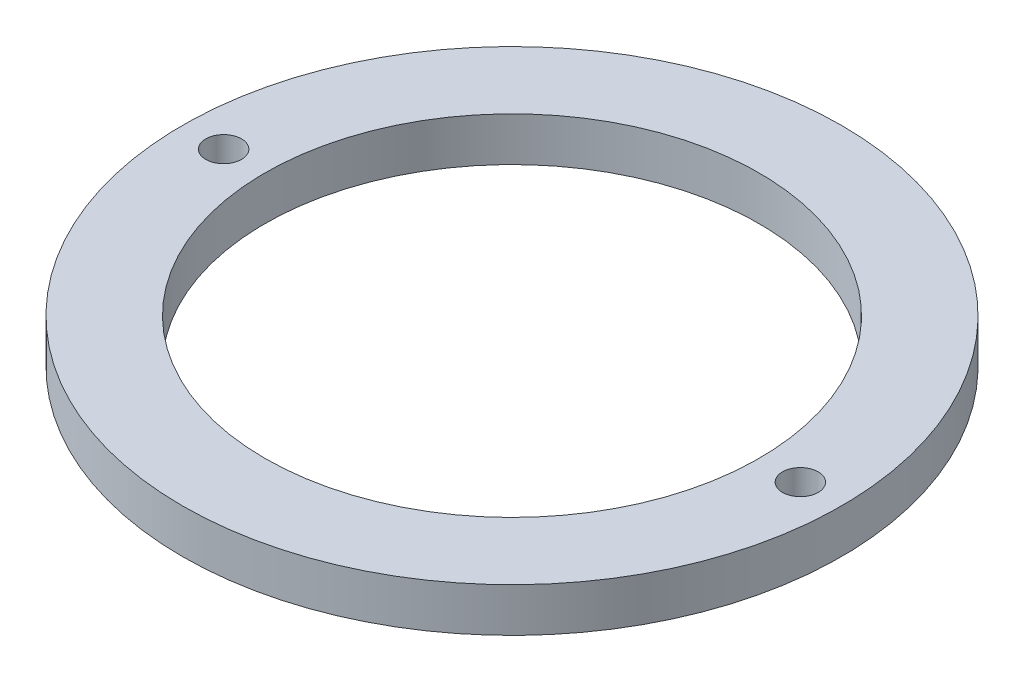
ISO-10303-21;
HEADER;
FILE_DESCRIPTION(('STEP AP214'),'2;1');
FILE_NAME('part.step','',(''),(''),'','','');
FILE_SCHEMA(('AUTOMOTIVE_DESIGN { 1 0 10303 214 1 1 1 1 }'));
ENDSEC;
DATA;
#1=APPLICATION_CONTEXT('core data for automotive mechanical design processes');
#2=APPLICATION_PROTOCOL_DEFINITION('international standard','automotive_design',2000,#1);
#3=PRODUCT_CONTEXT('',#1,'mechanical');
#4=PRODUCT('Part','Part','',(#3));
#5=PRODUCT_RELATED_PRODUCT_CATEGORY('part','',(#4));
#6=PRODUCT_DEFINITION_FORMATION('','',#4);
#7=PRODUCT_DEFINITION_CONTEXT('part definition',#1,'design');
#8=PRODUCT_DEFINITION('design','',#6,#7);
#9=PRODUCT_DEFINITION_SHAPE('','',#8);
#10=(LENGTH_UNIT() NAMED_UNIT(*) SI_UNIT(.MILLI.,.METRE.));
#11=(NAMED_UNIT(*) PLANE_ANGLE_UNIT() SI_UNIT($,.RADIAN.));
#12=(NAMED_UNIT(*) SI_UNIT($,.STERADIAN.) SOLID_ANGLE_UNIT());
#13=UNCERTAINTY_MEASURE_WITH_UNIT(LENGTH_MEASURE(1.E-05),#10,'distance_accuracy_value','');
#14=(GEOMETRIC_REPRESENTATION_CONTEXT(3) GLOBAL_UNCERTAINTY_ASSIGNED_CONTEXT((#13)) GLOBAL_UNIT_ASSIGNED_CONTEXT((#10,
#11,#12)) REPRESENTATION_CONTEXT('',''));
#15=CARTESIAN_POINT('',(0.,0.,0.));
#16=DIRECTION('',(0.,0.,1.));
#17=DIRECTION('',(1.,0.,0.));
#18=AXIS2_PLACEMENT_3D('',#15,#16,#17);
#19=CARTESIAN_POINT('',(0.,8.,0.));
#20=DIRECTION('',(0.,1.,0.));
#21=DIRECTION('',(0.,0.,1.));
#22=AXIS2_PLACEMENT_3D('',#19,#20,#21);
#23=PLANE('',#22);
#24=CARTESIAN_POINT('',(-52.5,8.,0.));
#25=DIRECTION('',(0.,1.,0.));
#26=DIRECTION('',(0.,0.,1.));
#27=AXIS2_PLACEMENT_3D('',#24,#25,#26);
#28=CIRCLE('',#27,3.25);
#29=CARTESIAN_POINT('',(-52.5,8.,3.25));
#30=VERTEX_POINT('',#29);
#31=EDGE_CURVE('E30',#30,#30,#28,.T.);
#32=ORIENTED_EDGE('',*,*,#31,.F.);
#33=EDGE_LOOP('',(#32));
#34=FACE_BOUND('',#33,.T.);
#35=CARTESIAN_POINT('',(0.,8.,0.));
#36=DIRECTION('',(0.,1.,0.));
#37=DIRECTION('',(0.,0.,1.));
#38=AXIS2_PLACEMENT_3D('',#35,#36,#37);
#39=CIRCLE('',#38,60.);
#40=CARTESIAN_POINT('',(0.,8.,60.));
#41=VERTEX_POINT('',#40);
#42=EDGE_CURVE('E9',#41,#41,#39,.T.);
#43=ORIENTED_EDGE('',*,*,#42,.T.);
#44=EDGE_LOOP('',(#43));
#45=FACE_BOUND('',#44,.T.);
#46=CARTESIAN_POINT('',(0.,8.,0.));
#47=DIRECTION('',(0.,1.,0.));
#48=DIRECTION('',(0.,0.,1.));
#49=AXIS2_PLACEMENT_3D('',#46,#47,#48);
#50=CIRCLE('',#49,45.);
#51=CARTESIAN_POINT('',(0.,8.,45.));
#52=VERTEX_POINT('',#51);
#53=EDGE_CURVE('E25',#52,#52,#50,.T.);
#54=ORIENTED_EDGE('',*,*,#53,.F.);
#55=EDGE_LOOP('',(#54));
#56=FACE_BOUND('',#55,.T.);
#57=CARTESIAN_POINT('',(52.5,8.,0.));
#58=DIRECTION('',(0.,1.,0.));
#59=DIRECTION('',(0.,0.,1.));
#60=AXIS2_PLACEMENT_3D('',#57,#58,#59);
#61=CIRCLE('',#60,3.25);
#62=CARTESIAN_POINT('',(52.5,8.,3.25));
#63=VERTEX_POINT('',#62);
#64=EDGE_CURVE('E36',#63,#63,#61,.T.);
#65=ORIENTED_EDGE('',*,*,#64,.F.);
#66=EDGE_LOOP('',(#65));
#67=FACE_BOUND('',#66,.T.);
#68=ADVANCED_FACE('F14',(#34,#45,#56,#67),#23,.T.);
#69=CARTESIAN_POINT('',(0.,0.,0.));
#70=DIRECTION('',(0.,1.,0.));
#71=DIRECTION('',(0.,0.,1.));
#72=AXIS2_PLACEMENT_3D('',#69,#70,#71);
#73=PLANE('',#72);
#74=CARTESIAN_POINT('',(0.,0.,0.));
#75=DIRECTION('',(0.,1.,0.));
#76=DIRECTION('',(0.,0.,1.));
#77=AXIS2_PLACEMENT_3D('',#74,#75,#76);
#78=CIRCLE('',#77,60.);
#79=CARTESIAN_POINT('',(0.,0.,60.));
#80=VERTEX_POINT('',#79);
#81=EDGE_CURVE('E18',#80,#80,#78,.T.);
#82=ORIENTED_EDGE('',*,*,#81,.F.);
#83=EDGE_LOOP('',(#82));
#84=FACE_BOUND('',#83,.T.);
#85=CARTESIAN_POINT('',(0.,0.,0.));
#86=DIRECTION('',(0.,1.,0.));
#87=DIRECTION('',(0.,0.,1.));
#88=AXIS2_PLACEMENT_3D('',#85,#86,#87);
#89=CIRCLE('',#88,45.);
#90=CARTESIAN_POINT('',(0.,0.,45.));
#91=VERTEX_POINT('',#90);
#92=EDGE_CURVE('E27',#91,#91,#89,.T.);
#93=ORIENTED_EDGE('',*,*,#92,.T.);
#94=EDGE_LOOP('',(#93));
#95=FACE_BOUND('',#94,.T.);
#96=CARTESIAN_POINT('',(-52.5,0.,0.));
#97=DIRECTION('',(0.,1.,0.));
#98=DIRECTION('',(0.,0.,1.));
#99=AXIS2_PLACEMENT_3D('',#96,#97,#98);
#100=CIRCLE('',#99,3.25);
#101=CARTESIAN_POINT('',(-52.5,0.,3.25));
#102=VERTEX_POINT('',#101);
#103=EDGE_CURVE('E33',#102,#102,#100,.T.);
#104=ORIENTED_EDGE('',*,*,#103,.T.);
#105=EDGE_LOOP('',(#104));
#106=FACE_BOUND('',#105,.T.);
#107=CARTESIAN_POINT('',(52.5,0.,0.));
#108=DIRECTION('',(0.,1.,0.));
#109=DIRECTION('',(0.,0.,1.));
#110=AXIS2_PLACEMENT_3D('',#107,#108,#109);
#111=CIRCLE('',#110,3.25);
#112=CARTESIAN_POINT('',(52.5,0.,3.25));
#113=VERTEX_POINT('',#112);
#114=EDGE_CURVE('E39',#113,#113,#111,.T.);
#115=ORIENTED_EDGE('',*,*,#114,.T.);
#116=EDGE_LOOP('',(#115));
#117=FACE_BOUND('',#116,.T.);
#118=ADVANCED_FACE('F49',(#84,#95,#106,#117),#73,.F.);
#119=CARTESIAN_POINT('',(0.,8.,0.));
#120=DIRECTION('',(0.,-1.,0.));
#121=DIRECTION('',(0.,0.,-1.));
#122=AXIS2_PLACEMENT_3D('',#119,#120,#121);
#123=CYLINDRICAL_SURFACE('',#122,60.);
#124=ORIENTED_EDGE('',*,*,#42,.F.);
#125=EDGE_LOOP('',(#124));
#126=FACE_BOUND('',#125,.T.);
#127=ORIENTED_EDGE('',*,*,#81,.T.);
#128=EDGE_LOOP('',(#127));
#129=FACE_BOUND('',#128,.T.);
#130=ADVANCED_FACE('F16',(#126,#129),#123,.T.);
#131=CARTESIAN_POINT('',(0.,8.,0.));
#132=DIRECTION('',(0.,-1.,0.));
#133=DIRECTION('',(0.,0.,-1.));
#134=AXIS2_PLACEMENT_3D('',#131,#132,#133);
#135=CYLINDRICAL_SURFACE('',#134,45.);
#136=ORIENTED_EDGE('',*,*,#53,.T.);
#137=EDGE_LOOP('',(#136));
#138=FACE_BOUND('',#137,.T.);
#139=ORIENTED_EDGE('',*,*,#92,.F.);
#140=EDGE_LOOP('',(#139));
#141=FACE_BOUND('',#140,.T.);
#142=ADVANCED_FACE('F60',(#138,#141),#135,.F.);
#143=CARTESIAN_POINT('',(-52.5,8.,0.));
#144=DIRECTION('',(0.,-1.,0.));
#145=DIRECTION('',(0.,0.,-1.));
#146=AXIS2_PLACEMENT_3D('',#143,#144,#145);
#147=CYLINDRICAL_SURFACE('',#146,3.25);
#148=ORIENTED_EDGE('',*,*,#31,.T.);
#149=EDGE_LOOP('',(#148));
#150=FACE_BOUND('',#149,.T.);
#151=ORIENTED_EDGE('',*,*,#103,.F.);
#152=EDGE_LOOP('',(#151));
#153=FACE_BOUND('',#152,.T.);
#154=ADVANCED_FACE('F63',(#150,#153),#147,.F.);
#155=CARTESIAN_POINT('',(52.5,8.,0.));
#156=DIRECTION('',(0.,-1.,0.));
#157=DIRECTION('',(0.,0.,-1.));
#158=AXIS2_PLACEMENT_3D('',#155,#156,#157);
#159=CYLINDRICAL_SURFACE('',#158,3.25);
#160=ORIENTED_EDGE('',*,*,#64,.T.);
#161=EDGE_LOOP('',(#160));
#162=FACE_BOUND('',#161,.T.);
#163=ORIENTED_EDGE('',*,*,#114,.F.);
#164=EDGE_LOOP('',(#163));
#165=FACE_BOUND('',#164,.T.);
#166=ADVANCED_FACE('F45',(#162,#165),#159,.F.);
#167=CLOSED_SHELL('',(#68,#118,#130,#142,#154,#166));
#168=MANIFOLD_SOLID_BREP('B1',#167);
#169=ADVANCED_BREP_SHAPE_REPRESENTATION('',(#18,#168),#14);
#170=SHAPE_DEFINITION_REPRESENTATION(#9,#169);
ENDSEC;
END-ISO-10303-21;
